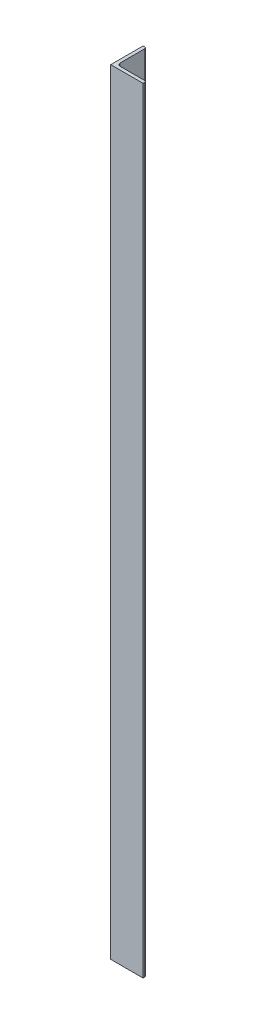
ISO-10303-21;
HEADER;
FILE_DESCRIPTION(('STEP AP214'),'2;1');
FILE_NAME('part.step','',(''),(''),'','','');
FILE_SCHEMA(('AUTOMOTIVE_DESIGN { 1 0 10303 214 1 1 1 1 }'));
ENDSEC;
DATA;
#1=APPLICATION_CONTEXT('core data for automotive mechanical design processes');
#2=APPLICATION_PROTOCOL_DEFINITION('international standard','automotive_design',2000,#1);
#3=PRODUCT_CONTEXT('',#1,'mechanical');
#4=PRODUCT('Part','Part','',(#3));
#5=PRODUCT_RELATED_PRODUCT_CATEGORY('part','',(#4));
#6=PRODUCT_DEFINITION_FORMATION('','',#4);
#7=PRODUCT_DEFINITION_CONTEXT('part definition',#1,'design');
#8=PRODUCT_DEFINITION('design','',#6,#7);
#9=PRODUCT_DEFINITION_SHAPE('','',#8);
#10=(LENGTH_UNIT() NAMED_UNIT(*) SI_UNIT(.MILLI.,.METRE.));
#11=(NAMED_UNIT(*) PLANE_ANGLE_UNIT() SI_UNIT($,.RADIAN.));
#12=(NAMED_UNIT(*) SI_UNIT($,.STERADIAN.) SOLID_ANGLE_UNIT());
#13=UNCERTAINTY_MEASURE_WITH_UNIT(LENGTH_MEASURE(1.E-05),#10,'distance_accuracy_value','');
#14=(GEOMETRIC_REPRESENTATION_CONTEXT(3) GLOBAL_UNCERTAINTY_ASSIGNED_CONTEXT((#13)) GLOBAL_UNIT_ASSIGNED_CONTEXT((#10,
#11,#12)) REPRESENTATION_CONTEXT('',''));
#15=CARTESIAN_POINT('',(0.,0.,0.));
#16=DIRECTION('',(0.,0.,1.));
#17=DIRECTION('',(1.,0.,0.));
#18=AXIS2_PLACEMENT_3D('',#15,#16,#17);
#19=CARTESIAN_POINT('',(-2.5,1200.,-47.5));
#20=DIRECTION('',(0.,0.,1.));
#21=DIRECTION('',(1.,0.,0.));
#22=AXIS2_PLACEMENT_3D('',#19,#20,#21);
#23=PLANE('',#22);
#24=DIRECTION('',(-1.,0.,0.));
#25=VECTOR('',#24,1.);
#26=CARTESIAN_POINT('',(-2.5,0.,-47.5));
#27=LINE('',#26,#25);
#28=CARTESIAN_POINT('',(0.,0.,-47.5));
#29=VERTEX_POINT('',#28);
#30=CARTESIAN_POINT('',(-2.5,0.,-47.5));
#31=VERTEX_POINT('',#30);
#32=EDGE_CURVE('E132',#29,#31,#27,.T.);
#33=ORIENTED_EDGE('',*,*,#32,.T.);
#34=DIRECTION('',(0.,-1.,0.));
#35=VECTOR('',#34,1.);
#36=CARTESIAN_POINT('',(-2.5,1200.,-47.5));
#37=LINE('',#36,#35);
#38=CARTESIAN_POINT('',(-2.5,1200.,-47.5));
#39=VERTEX_POINT('',#38);
#40=EDGE_CURVE('E11',#39,#31,#37,.T.);
#41=ORIENTED_EDGE('',*,*,#40,.F.);
#42=DIRECTION('',(-1.,0.,0.));
#43=VECTOR('',#42,1.);
#44=CARTESIAN_POINT('',(-2.5,1200.,-47.5));
#45=LINE('',#44,#43);
#46=CARTESIAN_POINT('',(0.,1200.,-47.5));
#47=VERTEX_POINT('',#46);
#48=EDGE_CURVE('E148',#47,#39,#45,.T.);
#49=ORIENTED_EDGE('',*,*,#48,.F.);
#50=DIRECTION('',(0.,-1.,0.));
#51=VECTOR('',#50,1.);
#52=CARTESIAN_POINT('',(0.,1200.,-47.5));
#53=LINE('',#52,#51);
#54=EDGE_CURVE('E128',#47,#29,#53,.T.);
#55=ORIENTED_EDGE('',*,*,#54,.T.);
#56=EDGE_LOOP('',(#33,#41,#49,#55));
#57=FACE_BOUND('',#56,.T.);
#58=ADVANCED_FACE('F30',(#57),#23,.F.);
#59=CARTESIAN_POINT('',(-2.5,1200.,-47.5));
#60=DIRECTION('',(1.,0.,0.));
#61=DIRECTION('',(0.,0.,-1.));
#62=AXIS2_PLACEMENT_3D('',#59,#60,#61);
#63=PLANE('',#62);
#64=DIRECTION('',(0.,0.,1.));
#65=VECTOR('',#64,1.);
#66=CARTESIAN_POINT('',(-2.5,0.,-47.5));
#67=LINE('',#66,#65);
#68=CARTESIAN_POINT('',(-2.50000000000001,0.,2.49999999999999));
#69=VERTEX_POINT('',#68);
#70=EDGE_CURVE('E135',#31,#69,#67,.T.);
#71=ORIENTED_EDGE('',*,*,#70,.T.);
#72=DIRECTION('',(0.,-1.,0.));
#73=VECTOR('',#72,1.);
#74=CARTESIAN_POINT('',(-2.50000000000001,1200.,2.49999999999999));
#75=LINE('',#74,#73);
#76=CARTESIAN_POINT('',(-2.50000000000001,1200.,2.49999999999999));
#77=VERTEX_POINT('',#76);
#78=EDGE_CURVE('E38',#77,#69,#75,.T.);
#79=ORIENTED_EDGE('',*,*,#78,.F.);
#80=DIRECTION('',(0.,0.,1.));
#81=VECTOR('',#80,1.);
#82=CARTESIAN_POINT('',(-2.5,1200.,-47.5));
#83=LINE('',#82,#81);
#84=EDGE_CURVE('E92',#39,#77,#83,.T.);
#85=ORIENTED_EDGE('',*,*,#84,.F.);
#86=ORIENTED_EDGE('',*,*,#40,.T.);
#87=EDGE_LOOP('',(#71,#79,#85,#86));
#88=FACE_BOUND('',#87,.T.);
#89=ADVANCED_FACE('F191',(#88),#63,.F.);
#90=CARTESIAN_POINT('',(-2.50000000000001,1200.,2.49999999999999));
#91=DIRECTION('',(0.,0.,-1.));
#92=DIRECTION('',(-1.,0.,0.));
#93=AXIS2_PLACEMENT_3D('',#90,#91,#92);
#94=PLANE('',#93);
#95=DIRECTION('',(1.,0.,0.));
#96=VECTOR('',#95,1.);
#97=CARTESIAN_POINT('',(-2.50000000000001,0.,2.49999999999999));
#98=LINE('',#97,#96);
#99=CARTESIAN_POINT('',(47.5,0.,2.49999999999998));
#100=VERTEX_POINT('',#99);
#101=EDGE_CURVE('E137',#69,#100,#98,.T.);
#102=ORIENTED_EDGE('',*,*,#101,.T.);
#103=DIRECTION('',(0.,-1.,0.));
#104=VECTOR('',#103,1.);
#105=CARTESIAN_POINT('',(47.5,1200.,2.49999999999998));
#106=LINE('',#105,#104);
#107=CARTESIAN_POINT('',(47.5,1200.,2.49999999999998));
#108=VERTEX_POINT('',#107);
#109=EDGE_CURVE('E158',#108,#100,#106,.T.);
#110=ORIENTED_EDGE('',*,*,#109,.F.);
#111=DIRECTION('',(1.,0.,0.));
#112=VECTOR('',#111,1.);
#113=CARTESIAN_POINT('',(-2.50000000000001,1200.,2.49999999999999));
#114=LINE('',#113,#112);
#115=EDGE_CURVE('E166',#77,#108,#114,.T.);
#116=ORIENTED_EDGE('',*,*,#115,.F.);
#117=ORIENTED_EDGE('',*,*,#78,.T.);
#118=EDGE_LOOP('',(#102,#110,#116,#117));
#119=FACE_BOUND('',#118,.T.);
#120=ADVANCED_FACE('F164',(#119),#94,.F.);
#121=CARTESIAN_POINT('',(47.5,1200.,2.49999999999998));
#122=DIRECTION('',(-1.,0.,0.));
#123=DIRECTION('',(0.,0.,1.));
#124=AXIS2_PLACEMENT_3D('',#121,#122,#123);
#125=PLANE('',#124);
#126=DIRECTION('',(0.,0.,-1.));
#127=VECTOR('',#126,1.);
#128=CARTESIAN_POINT('',(47.5,0.,2.49999999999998));
#129=LINE('',#128,#127);
#130=CARTESIAN_POINT('',(47.5,0.,0.));
#131=VERTEX_POINT('',#130);
#132=EDGE_CURVE('E139',#100,#131,#129,.T.);
#133=ORIENTED_EDGE('',*,*,#132,.T.);
#134=DIRECTION('',(0.,-1.,0.));
#135=VECTOR('',#134,1.);
#136=CARTESIAN_POINT('',(47.5,1200.,0.));
#137=LINE('',#136,#135);
#138=CARTESIAN_POINT('',(47.5,1200.,0.));
#139=VERTEX_POINT('',#138);
#140=EDGE_CURVE('E155',#139,#131,#137,.T.);
#141=ORIENTED_EDGE('',*,*,#140,.F.);
#142=DIRECTION('',(0.,0.,-1.));
#143=VECTOR('',#142,1.);
#144=CARTESIAN_POINT('',(47.5,1200.,2.49999999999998));
#145=LINE('',#144,#143);
#146=EDGE_CURVE('E182',#108,#139,#145,.T.);
#147=ORIENTED_EDGE('',*,*,#146,.F.);
#148=ORIENTED_EDGE('',*,*,#109,.T.);
#149=EDGE_LOOP('',(#133,#141,#147,#148));
#150=FACE_BOUND('',#149,.T.);
#151=ADVANCED_FACE('F175',(#150),#125,.F.);
#152=CARTESIAN_POINT('',(45.,1200.,0.));
#153=DIRECTION('',(0.,-1.,0.));
#154=DIRECTION('',(0.,0.,-1.));
#155=AXIS2_PLACEMENT_3D('',#152,#153,#154);
#156=CYLINDRICAL_SURFACE('',#155,2.5);
#157=CARTESIAN_POINT('',(45.,0.,0.));
#158=DIRECTION('',(0.,1.,0.));
#159=DIRECTION('',(0.,0.,-1.));
#160=AXIS2_PLACEMENT_3D('',#157,#158,#159);
#161=CIRCLE('',#160,2.5);
#162=CARTESIAN_POINT('',(45.,0.,-2.49999999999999));
#163=VERTEX_POINT('',#162);
#164=EDGE_CURVE('E141',#131,#163,#161,.T.);
#165=ORIENTED_EDGE('',*,*,#164,.T.);
#166=DIRECTION('',(0.,-1.,0.));
#167=VECTOR('',#166,1.);
#168=CARTESIAN_POINT('',(45.,1200.,-2.49999999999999));
#169=LINE('',#168,#167);
#170=CARTESIAN_POINT('',(45.,1200.,-2.49999999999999));
#171=VERTEX_POINT('',#170);
#172=EDGE_CURVE('E152',#171,#163,#169,.T.);
#173=ORIENTED_EDGE('',*,*,#172,.F.);
#174=CARTESIAN_POINT('',(45.,1200.,0.));
#175=DIRECTION('',(0.,1.,0.));
#176=DIRECTION('',(0.,0.,-1.));
#177=AXIS2_PLACEMENT_3D('',#174,#175,#176);
#178=CIRCLE('',#177,2.5);
#179=EDGE_CURVE('E181',#139,#171,#178,.T.);
#180=ORIENTED_EDGE('',*,*,#179,.F.);
#181=ORIENTED_EDGE('',*,*,#140,.T.);
#182=EDGE_LOOP('',(#165,#173,#180,#181));
#183=FACE_BOUND('',#182,.T.);
#184=ADVANCED_FACE('F179',(#183),#156,.T.);
#185=CARTESIAN_POINT('',(45.,1200.,-2.49999999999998));
#186=DIRECTION('',(0.,0.,1.));
#187=DIRECTION('',(1.,0.,0.));
#188=AXIS2_PLACEMENT_3D('',#185,#186,#187);
#189=PLANE('',#188);
#190=DIRECTION('',(-1.,0.,0.));
#191=VECTOR('',#190,1.);
#192=CARTESIAN_POINT('',(45.,0.,-2.49999999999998));
#193=LINE('',#192,#191);
#194=CARTESIAN_POINT('',(7.50000000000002,0.,-2.5));
#195=VERTEX_POINT('',#194);
#196=EDGE_CURVE('E143',#163,#195,#193,.T.);
#197=ORIENTED_EDGE('',*,*,#196,.T.);
#198=DIRECTION('',(0.,-1.,0.));
#199=VECTOR('',#198,1.);
#200=CARTESIAN_POINT('',(7.50000000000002,1200.,-2.5));
#201=LINE('',#200,#199);
#202=CARTESIAN_POINT('',(7.50000000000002,1200.,-2.5));
#203=VERTEX_POINT('',#202);
#204=EDGE_CURVE('E123',#203,#195,#201,.T.);
#205=ORIENTED_EDGE('',*,*,#204,.F.);
#206=DIRECTION('',(-1.,0.,0.));
#207=VECTOR('',#206,1.);
#208=CARTESIAN_POINT('',(45.,1200.,-2.49999999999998));
#209=LINE('',#208,#207);
#210=EDGE_CURVE('E114',#171,#203,#209,.T.);
#211=ORIENTED_EDGE('',*,*,#210,.F.);
#212=ORIENTED_EDGE('',*,*,#172,.T.);
#213=EDGE_LOOP('',(#197,#205,#211,#212));
#214=FACE_BOUND('',#213,.T.);
#215=ADVANCED_FACE('F203',(#214),#189,.F.);
#216=CARTESIAN_POINT('',(7.49999999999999,1200.,-7.5));
#217=DIRECTION('',(0.,-1.,0.));
#218=DIRECTION('',(0.,0.,-1.));
#219=AXIS2_PLACEMENT_3D('',#216,#217,#218);
#220=CYLINDRICAL_SURFACE('',#219,5.);
#221=CARTESIAN_POINT('',(7.49999999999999,0.,-7.5));
#222=DIRECTION('',(0.,-1.,0.));
#223=DIRECTION('',(0.,0.,1.));
#224=AXIS2_PLACEMENT_3D('',#221,#222,#223);
#225=CIRCLE('',#224,5.);
#226=CARTESIAN_POINT('',(2.49999999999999,0.,-7.50000000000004));
#227=VERTEX_POINT('',#226);
#228=EDGE_CURVE('E122',#195,#227,#225,.T.);
#229=ORIENTED_EDGE('',*,*,#228,.T.);
#230=DIRECTION('',(0.,-1.,0.));
#231=VECTOR('',#230,1.);
#232=CARTESIAN_POINT('',(2.49999999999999,1200.,-7.50000000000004));
#233=LINE('',#232,#231);
#234=CARTESIAN_POINT('',(2.49999999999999,1200.,-7.50000000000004));
#235=VERTEX_POINT('',#234);
#236=EDGE_CURVE('E119',#235,#227,#233,.T.);
#237=ORIENTED_EDGE('',*,*,#236,.F.);
#238=CARTESIAN_POINT('',(7.49999999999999,1200.,-7.5));
#239=DIRECTION('',(0.,-1.,0.));
#240=DIRECTION('',(0.,0.,1.));
#241=AXIS2_PLACEMENT_3D('',#238,#239,#240);
#242=CIRCLE('',#241,5.);
#243=EDGE_CURVE('E108',#203,#235,#242,.T.);
#244=ORIENTED_EDGE('',*,*,#243,.F.);
#245=ORIENTED_EDGE('',*,*,#204,.T.);
#246=EDGE_LOOP('',(#229,#237,#244,#245));
#247=FACE_BOUND('',#246,.T.);
#248=ADVANCED_FACE('F120',(#247),#220,.F.);
#249=CARTESIAN_POINT('',(2.49999999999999,1200.,-7.50000000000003));
#250=DIRECTION('',(-1.,0.,0.));
#251=DIRECTION('',(0.,0.,1.));
#252=AXIS2_PLACEMENT_3D('',#249,#250,#251);
#253=PLANE('',#252);
#254=DIRECTION('',(0.,0.,-1.));
#255=VECTOR('',#254,1.);
#256=CARTESIAN_POINT('',(2.49999999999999,0.,-7.50000000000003));
#257=LINE('',#256,#255);
#258=CARTESIAN_POINT('',(2.49999999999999,0.,-45.));
#259=VERTEX_POINT('',#258);
#260=EDGE_CURVE('E78',#227,#259,#257,.T.);
#261=ORIENTED_EDGE('',*,*,#260,.T.);
#262=DIRECTION('',(0.,-1.,0.));
#263=VECTOR('',#262,1.);
#264=CARTESIAN_POINT('',(2.49999999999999,1200.,-45.));
#265=LINE('',#264,#263);
#266=CARTESIAN_POINT('',(2.49999999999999,1200.,-45.));
#267=VERTEX_POINT('',#266);
#268=EDGE_CURVE('E124',#267,#259,#265,.T.);
#269=ORIENTED_EDGE('',*,*,#268,.F.);
#270=DIRECTION('',(0.,0.,-1.));
#271=VECTOR('',#270,1.);
#272=CARTESIAN_POINT('',(2.49999999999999,1200.,-7.50000000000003));
#273=LINE('',#272,#271);
#274=EDGE_CURVE('E112',#235,#267,#273,.T.);
#275=ORIENTED_EDGE('',*,*,#274,.F.);
#276=ORIENTED_EDGE('',*,*,#236,.T.);
#277=EDGE_LOOP('',(#261,#269,#275,#276));
#278=FACE_BOUND('',#277,.T.);
#279=ADVANCED_FACE('F126',(#278),#253,.F.);
#280=CARTESIAN_POINT('',(0.,1200.,-45.));
#281=DIRECTION('',(0.,-1.,0.));
#282=DIRECTION('',(0.,0.,-1.));
#283=AXIS2_PLACEMENT_3D('',#280,#281,#282);
#284=CYLINDRICAL_SURFACE('',#283,2.5);
#285=CARTESIAN_POINT('',(0.,0.,-45.));
#286=DIRECTION('',(0.,1.,0.));
#287=DIRECTION('',(0.,0.,-1.));
#288=AXIS2_PLACEMENT_3D('',#285,#286,#287);
#289=CIRCLE('',#288,2.5);
#290=EDGE_CURVE('E84',#259,#29,#289,.T.);
#291=ORIENTED_EDGE('',*,*,#290,.T.);
#292=ORIENTED_EDGE('',*,*,#54,.F.);
#293=CARTESIAN_POINT('',(0.,1200.,-45.));
#294=DIRECTION('',(0.,1.,0.));
#295=DIRECTION('',(0.,0.,-1.));
#296=AXIS2_PLACEMENT_3D('',#293,#294,#295);
#297=CIRCLE('',#296,2.5);
#298=EDGE_CURVE('E46',#267,#47,#297,.T.);
#299=ORIENTED_EDGE('',*,*,#298,.F.);
#300=ORIENTED_EDGE('',*,*,#268,.T.);
#301=EDGE_LOOP('',(#291,#292,#299,#300));
#302=FACE_BOUND('',#301,.T.);
#303=ADVANCED_FACE('F211',(#302),#284,.T.);
#304=CARTESIAN_POINT('',(0.,1200.,-45.));
#305=DIRECTION('',(0.,-1.,0.));
#306=DIRECTION('',(0.,0.,-1.));
#307=AXIS2_PLACEMENT_3D('',#304,#305,#306);
#308=PLANE('',#307);
#309=ORIENTED_EDGE('',*,*,#48,.T.);
#310=ORIENTED_EDGE('',*,*,#84,.T.);
#311=ORIENTED_EDGE('',*,*,#115,.T.);
#312=ORIENTED_EDGE('',*,*,#146,.T.);
#313=ORIENTED_EDGE('',*,*,#179,.T.);
#314=ORIENTED_EDGE('',*,*,#210,.T.);
#315=ORIENTED_EDGE('',*,*,#243,.T.);
#316=ORIENTED_EDGE('',*,*,#274,.T.);
#317=ORIENTED_EDGE('',*,*,#298,.T.);
#318=EDGE_LOOP('',(#309,#310,#311,#312,#313,#314,#315,#316,#317));
#319=FACE_BOUND('',#318,.T.);
#320=ADVANCED_FACE('F110',(#319),#308,.F.);
#321=CARTESIAN_POINT('',(0.,0.,-45.));
#322=DIRECTION('',(0.,-1.,0.));
#323=DIRECTION('',(0.,0.,-1.));
#324=AXIS2_PLACEMENT_3D('',#321,#322,#323);
#325=PLANE('',#324);
#326=ORIENTED_EDGE('',*,*,#32,.F.);
#327=ORIENTED_EDGE('',*,*,#290,.F.);
#328=ORIENTED_EDGE('',*,*,#260,.F.);
#329=ORIENTED_EDGE('',*,*,#228,.F.);
#330=ORIENTED_EDGE('',*,*,#196,.F.);
#331=ORIENTED_EDGE('',*,*,#164,.F.);
#332=ORIENTED_EDGE('',*,*,#132,.F.);
#333=ORIENTED_EDGE('',*,*,#101,.F.);
#334=ORIENTED_EDGE('',*,*,#70,.F.);
#335=EDGE_LOOP('',(#326,#327,#328,#329,#330,#331,#332,#333,#334));
#336=FACE_BOUND('',#335,.T.);
#337=ADVANCED_FACE('F170',(#336),#325,.T.);
#338=CLOSED_SHELL('',(#58,#89,#120,#151,#184,#215,#248,#279,#303,#320,#337));
#339=MANIFOLD_SOLID_BREP('B2',#338);
#340=ADVANCED_BREP_SHAPE_REPRESENTATION('',(#18,#339),#14);
#341=SHAPE_DEFINITION_REPRESENTATION(#9,#340);
ENDSEC;
END-ISO-10303-21;
